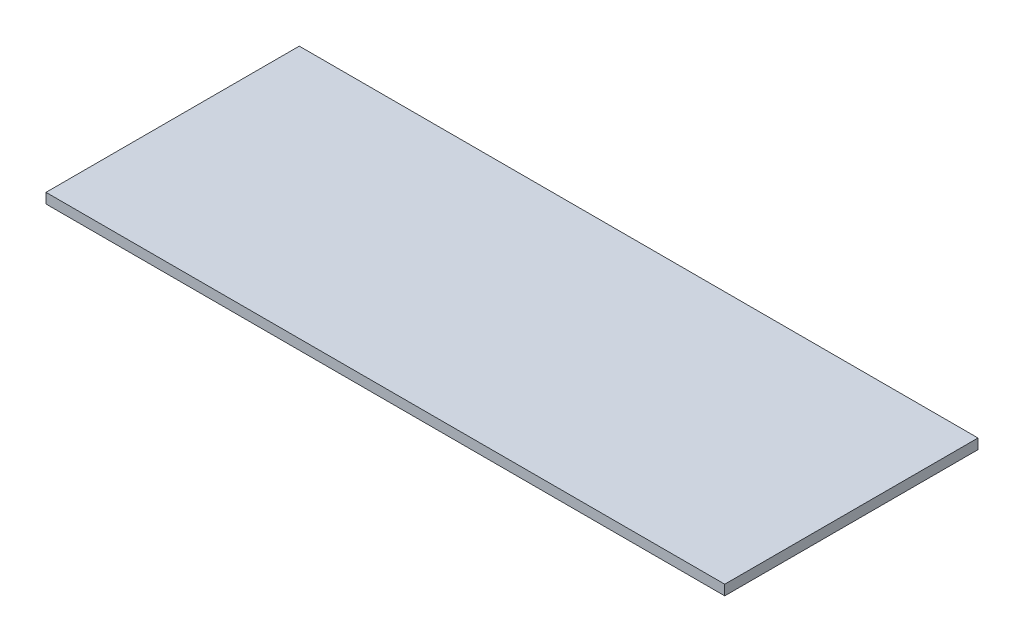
ISO-10303-21;
HEADER;
FILE_DESCRIPTION(('STEP AP214'),'2;1');
FILE_NAME('part.step','',(''),(''),'','','');
FILE_SCHEMA(('AUTOMOTIVE_DESIGN { 1 0 10303 214 1 1 1 1 }'));
ENDSEC;
DATA;
#1=APPLICATION_CONTEXT('core data for automotive mechanical design processes');
#2=APPLICATION_PROTOCOL_DEFINITION('international standard','automotive_design',2000,#1);
#3=PRODUCT_CONTEXT('',#1,'mechanical');
#4=PRODUCT('Part','Part','',(#3));
#5=PRODUCT_RELATED_PRODUCT_CATEGORY('part','',(#4));
#6=PRODUCT_DEFINITION_FORMATION('','',#4);
#7=PRODUCT_DEFINITION_CONTEXT('part definition',#1,'design');
#8=PRODUCT_DEFINITION('design','',#6,#7);
#9=PRODUCT_DEFINITION_SHAPE('','',#8);
#10=(LENGTH_UNIT() NAMED_UNIT(*) SI_UNIT(.MILLI.,.METRE.));
#11=(NAMED_UNIT(*) PLANE_ANGLE_UNIT() SI_UNIT($,.RADIAN.));
#12=(NAMED_UNIT(*) SI_UNIT($,.STERADIAN.) SOLID_ANGLE_UNIT());
#13=UNCERTAINTY_MEASURE_WITH_UNIT(LENGTH_MEASURE(1.E-05),#10,'distance_accuracy_value','');
#14=(GEOMETRIC_REPRESENTATION_CONTEXT(3) GLOBAL_UNCERTAINTY_ASSIGNED_CONTEXT((#13)) GLOBAL_UNIT_ASSIGNED_CONTEXT((#10,
#11,#12)) REPRESENTATION_CONTEXT('',''));
#15=CARTESIAN_POINT('',(0.,0.,0.));
#16=DIRECTION('',(0.,0.,1.));
#17=DIRECTION('',(1.,0.,0.));
#18=AXIS2_PLACEMENT_3D('',#15,#16,#17);
#19=CARTESIAN_POINT('',(67.,2.,-25.));
#20=DIRECTION('',(-1.,0.,0.));
#21=DIRECTION('',(0.,0.,1.));
#22=AXIS2_PLACEMENT_3D('',#19,#20,#21);
#23=PLANE('',#22);
#24=DIRECTION('',(0.,0.,-1.));
#25=VECTOR('',#24,1.);
#26=CARTESIAN_POINT('',(67.,0.,-25.));
#27=LINE('',#26,#25);
#28=CARTESIAN_POINT('',(67.,0.,25.));
#29=VERTEX_POINT('',#28);
#30=CARTESIAN_POINT('',(67.,0.,-25.));
#31=VERTEX_POINT('',#30);
#32=EDGE_CURVE('E96',#29,#31,#27,.T.);
#33=ORIENTED_EDGE('',*,*,#32,.T.);
#34=DIRECTION('',(0.,-1.,0.));
#35=VECTOR('',#34,1.);
#36=CARTESIAN_POINT('',(67.,2.,-25.));
#37=LINE('',#36,#35);
#38=CARTESIAN_POINT('',(67.,2.,-25.));
#39=VERTEX_POINT('',#38);
#40=EDGE_CURVE('E11',#39,#31,#37,.T.);
#41=ORIENTED_EDGE('',*,*,#40,.F.);
#42=DIRECTION('',(0.,0.,-1.));
#43=VECTOR('',#42,1.);
#44=CARTESIAN_POINT('',(67.,2.,-25.));
#45=LINE('',#44,#43);
#46=CARTESIAN_POINT('',(67.,2.,25.));
#47=VERTEX_POINT('',#46);
#48=EDGE_CURVE('E84',#47,#39,#45,.T.);
#49=ORIENTED_EDGE('',*,*,#48,.F.);
#50=DIRECTION('',(0.,-1.,0.));
#51=VECTOR('',#50,1.);
#52=CARTESIAN_POINT('',(67.,2.,25.));
#53=LINE('',#52,#51);
#54=EDGE_CURVE('E92',#47,#29,#53,.T.);
#55=ORIENTED_EDGE('',*,*,#54,.T.);
#56=EDGE_LOOP('',(#33,#41,#49,#55));
#57=FACE_BOUND('',#56,.T.);
#58=ADVANCED_FACE('F33',(#57),#23,.F.);
#59=CARTESIAN_POINT('',(-67.,2.,-25.));
#60=DIRECTION('',(0.,0.,1.));
#61=DIRECTION('',(1.,0.,0.));
#62=AXIS2_PLACEMENT_3D('',#59,#60,#61);
#63=PLANE('',#62);
#64=DIRECTION('',(-1.,0.,0.));
#65=VECTOR('',#64,1.);
#66=CARTESIAN_POINT('',(-67.,0.,-25.));
#67=LINE('',#66,#65);
#68=CARTESIAN_POINT('',(-67.,0.,-25.));
#69=VERTEX_POINT('',#68);
#70=EDGE_CURVE('E88',#31,#69,#67,.T.);
#71=ORIENTED_EDGE('',*,*,#70,.T.);
#72=DIRECTION('',(0.,-1.,0.));
#73=VECTOR('',#72,1.);
#74=CARTESIAN_POINT('',(-67.,2.,-25.));
#75=LINE('',#74,#73);
#76=CARTESIAN_POINT('',(-67.,2.,-25.));
#77=VERTEX_POINT('',#76);
#78=EDGE_CURVE('E41',#77,#69,#75,.T.);
#79=ORIENTED_EDGE('',*,*,#78,.F.);
#80=DIRECTION('',(-1.,0.,0.));
#81=VECTOR('',#80,1.);
#82=CARTESIAN_POINT('',(-67.,2.,-25.));
#83=LINE('',#82,#81);
#84=EDGE_CURVE('E79',#39,#77,#83,.T.);
#85=ORIENTED_EDGE('',*,*,#84,.F.);
#86=ORIENTED_EDGE('',*,*,#40,.T.);
#87=EDGE_LOOP('',(#71,#79,#85,#86));
#88=FACE_BOUND('',#87,.T.);
#89=ADVANCED_FACE('F87',(#88),#63,.F.);
#90=CARTESIAN_POINT('',(-67.,2.,-25.));
#91=DIRECTION('',(1.,0.,0.));
#92=DIRECTION('',(0.,0.,-1.));
#93=AXIS2_PLACEMENT_3D('',#90,#91,#92);
#94=PLANE('',#93);
#95=DIRECTION('',(0.,0.,1.));
#96=VECTOR('',#95,1.);
#97=CARTESIAN_POINT('',(-67.,0.,-25.));
#98=LINE('',#97,#96);
#99=CARTESIAN_POINT('',(-67.,0.,25.));
#100=VERTEX_POINT('',#99);
#101=EDGE_CURVE('E66',#69,#100,#98,.T.);
#102=ORIENTED_EDGE('',*,*,#101,.T.);
#103=DIRECTION('',(0.,-1.,0.));
#104=VECTOR('',#103,1.);
#105=CARTESIAN_POINT('',(-67.,2.,25.));
#106=LINE('',#105,#104);
#107=CARTESIAN_POINT('',(-67.,2.,25.));
#108=VERTEX_POINT('',#107);
#109=EDGE_CURVE('E89',#108,#100,#106,.T.);
#110=ORIENTED_EDGE('',*,*,#109,.F.);
#111=DIRECTION('',(0.,0.,1.));
#112=VECTOR('',#111,1.);
#113=CARTESIAN_POINT('',(-67.,2.,-25.));
#114=LINE('',#113,#112);
#115=EDGE_CURVE('E82',#77,#108,#114,.T.);
#116=ORIENTED_EDGE('',*,*,#115,.F.);
#117=ORIENTED_EDGE('',*,*,#78,.T.);
#118=EDGE_LOOP('',(#102,#110,#116,#117));
#119=FACE_BOUND('',#118,.T.);
#120=ADVANCED_FACE('F90',(#119),#94,.F.);
#121=CARTESIAN_POINT('',(-67.,2.,25.));
#122=DIRECTION('',(0.,0.,-1.));
#123=DIRECTION('',(-1.,0.,0.));
#124=AXIS2_PLACEMENT_3D('',#121,#122,#123);
#125=PLANE('',#124);
#126=DIRECTION('',(1.,0.,0.));
#127=VECTOR('',#126,1.);
#128=CARTESIAN_POINT('',(-67.,0.,25.));
#129=LINE('',#128,#127);
#130=EDGE_CURVE('E72',#100,#29,#129,.T.);
#131=ORIENTED_EDGE('',*,*,#130,.T.);
#132=ORIENTED_EDGE('',*,*,#54,.F.);
#133=DIRECTION('',(1.,0.,0.));
#134=VECTOR('',#133,1.);
#135=CARTESIAN_POINT('',(-67.,2.,25.));
#136=LINE('',#135,#134);
#137=EDGE_CURVE('E49',#108,#47,#136,.T.);
#138=ORIENTED_EDGE('',*,*,#137,.F.);
#139=ORIENTED_EDGE('',*,*,#109,.T.);
#140=EDGE_LOOP('',(#131,#132,#138,#139));
#141=FACE_BOUND('',#140,.T.);
#142=ADVANCED_FACE('F103',(#141),#125,.F.);
#143=CARTESIAN_POINT('',(0.,2.,0.));
#144=DIRECTION('',(0.,1.,0.));
#145=DIRECTION('',(0.,0.,1.));
#146=AXIS2_PLACEMENT_3D('',#143,#144,#145);
#147=PLANE('',#146);
#148=ORIENTED_EDGE('',*,*,#48,.T.);
#149=ORIENTED_EDGE('',*,*,#84,.T.);
#150=ORIENTED_EDGE('',*,*,#115,.T.);
#151=ORIENTED_EDGE('',*,*,#137,.T.);
#152=EDGE_LOOP('',(#148,#149,#150,#151));
#153=FACE_BOUND('',#152,.T.);
#154=ADVANCED_FACE('F80',(#153),#147,.T.);
#155=CARTESIAN_POINT('',(0.,0.,0.));
#156=DIRECTION('',(0.,1.,0.));
#157=DIRECTION('',(0.,0.,1.));
#158=AXIS2_PLACEMENT_3D('',#155,#156,#157);
#159=PLANE('',#158);
#160=ORIENTED_EDGE('',*,*,#32,.F.);
#161=ORIENTED_EDGE('',*,*,#130,.F.);
#162=ORIENTED_EDGE('',*,*,#101,.F.);
#163=ORIENTED_EDGE('',*,*,#70,.F.);
#164=EDGE_LOOP('',(#160,#161,#162,#163));
#165=FACE_BOUND('',#164,.T.);
#166=ADVANCED_FACE('F106',(#165),#159,.F.);
#167=CLOSED_SHELL('',(#58,#89,#120,#142,#154,#166));
#168=MANIFOLD_SOLID_BREP('B2',#167);
#169=ADVANCED_BREP_SHAPE_REPRESENTATION('',(#18,#168),#14);
#170=SHAPE_DEFINITION_REPRESENTATION(#9,#169);
ENDSEC;
END-ISO-10303-21;
